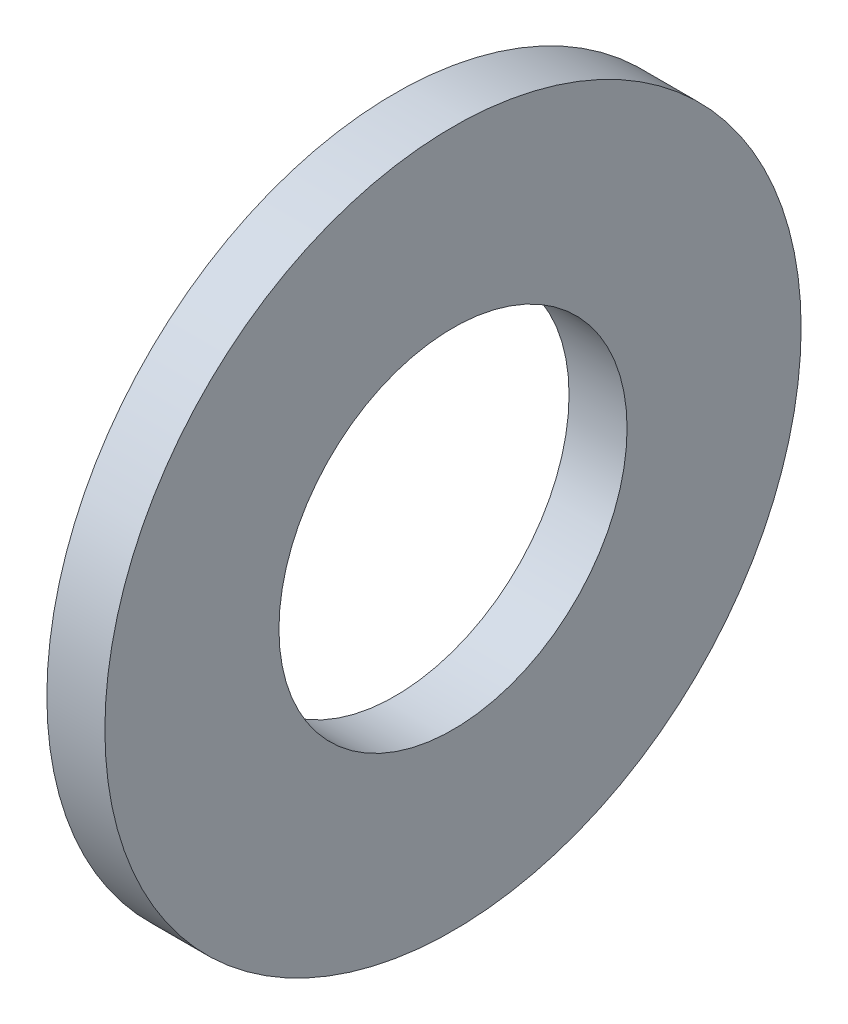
ISO-10303-21;
HEADER;
FILE_DESCRIPTION(('STEP AP214'),'2;1');
FILE_NAME('part.step','',(''),(''),'','','');
FILE_SCHEMA(('AUTOMOTIVE_DESIGN { 1 0 10303 214 1 1 1 1 }'));
ENDSEC;
DATA;
#1=APPLICATION_CONTEXT('core data for automotive mechanical design processes');
#2=APPLICATION_PROTOCOL_DEFINITION('international standard','automotive_design',2000,#1);
#3=PRODUCT_CONTEXT('',#1,'mechanical');
#4=PRODUCT('Part','Part','',(#3));
#5=PRODUCT_RELATED_PRODUCT_CATEGORY('part','',(#4));
#6=PRODUCT_DEFINITION_FORMATION('','',#4);
#7=PRODUCT_DEFINITION_CONTEXT('part definition',#1,'design');
#8=PRODUCT_DEFINITION('design','',#6,#7);
#9=PRODUCT_DEFINITION_SHAPE('','',#8);
#10=(LENGTH_UNIT() NAMED_UNIT(*) SI_UNIT(.MILLI.,.METRE.));
#11=(NAMED_UNIT(*) PLANE_ANGLE_UNIT() SI_UNIT($,.RADIAN.));
#12=(NAMED_UNIT(*) SI_UNIT($,.STERADIAN.) SOLID_ANGLE_UNIT());
#13=UNCERTAINTY_MEASURE_WITH_UNIT(LENGTH_MEASURE(1.E-05),#10,'distance_accuracy_value','');
#14=(GEOMETRIC_REPRESENTATION_CONTEXT(3) GLOBAL_UNCERTAINTY_ASSIGNED_CONTEXT((#13)) GLOBAL_UNIT_ASSIGNED_CONTEXT((#10,
#11,#12)) REPRESENTATION_CONTEXT('',''));
#15=CARTESIAN_POINT('',(0.,0.,0.));
#16=DIRECTION('',(0.,0.,1.));
#17=DIRECTION('',(1.,0.,0.));
#18=AXIS2_PLACEMENT_3D('',#15,#16,#17);
#19=CARTESIAN_POINT('',(0.,0.,-15.));
#20=DIRECTION('',(1.,0.,0.));
#21=DIRECTION('',(0.,0.,-1.));
#22=AXIS2_PLACEMENT_3D('',#19,#20,#21);
#23=PLANE('',#22);
#24=CARTESIAN_POINT('',(0.,0.,0.));
#25=DIRECTION('',(-1.,0.,0.));
#26=DIRECTION('',(0.,0.,1.));
#27=AXIS2_PLACEMENT_3D('',#24,#25,#26);
#28=CIRCLE('',#27,7.5);
#29=CARTESIAN_POINT('',(0.,0.,7.5));
#30=VERTEX_POINT('',#29);
#31=EDGE_CURVE('E10',#30,#30,#28,.T.);
#32=ORIENTED_EDGE('',*,*,#31,.F.);
#33=EDGE_LOOP('',(#32));
#34=FACE_BOUND('',#33,.T.);
#35=CARTESIAN_POINT('',(0.,0.,0.));
#36=DIRECTION('',(-1.,0.,0.));
#37=DIRECTION('',(0.,0.,1.));
#38=AXIS2_PLACEMENT_3D('',#35,#36,#37);
#39=CIRCLE('',#38,15.);
#40=CARTESIAN_POINT('',(0.,0.,15.));
#41=VERTEX_POINT('',#40);
#42=EDGE_CURVE('E46',#41,#41,#39,.T.);
#43=ORIENTED_EDGE('',*,*,#42,.T.);
#44=EDGE_LOOP('',(#43));
#45=FACE_BOUND('',#44,.T.);
#46=ADVANCED_FACE('F32',(#34,#45),#23,.F.);
#47=CARTESIAN_POINT('',(0.,0.,0.));
#48=DIRECTION('',(-1.,0.,0.));
#49=DIRECTION('',(0.,0.,1.));
#50=AXIS2_PLACEMENT_3D('',#47,#48,#49);
#51=CYLINDRICAL_SURFACE('',#50,7.5);
#52=CARTESIAN_POINT('',(2.5,0.,0.));
#53=DIRECTION('',(-1.,0.,0.));
#54=DIRECTION('',(0.,0.,1.));
#55=AXIS2_PLACEMENT_3D('',#52,#53,#54);
#56=CIRCLE('',#55,7.5);
#57=CARTESIAN_POINT('',(2.5,0.,7.5));
#58=VERTEX_POINT('',#57);
#59=EDGE_CURVE('E38',#58,#58,#56,.T.);
#60=ORIENTED_EDGE('',*,*,#59,.F.);
#61=EDGE_LOOP('',(#60));
#62=FACE_BOUND('',#61,.T.);
#63=ORIENTED_EDGE('',*,*,#31,.T.);
#64=EDGE_LOOP('',(#63));
#65=FACE_BOUND('',#64,.T.);
#66=ADVANCED_FACE('F61',(#62,#65),#51,.F.);
#67=CARTESIAN_POINT('',(2.5,0.,-15.));
#68=DIRECTION('',(-1.,0.,0.));
#69=DIRECTION('',(0.,0.,1.));
#70=AXIS2_PLACEMENT_3D('',#67,#68,#69);
#71=PLANE('',#70);
#72=CARTESIAN_POINT('',(2.5,0.,0.));
#73=DIRECTION('',(-1.,0.,0.));
#74=DIRECTION('',(0.,0.,1.));
#75=AXIS2_PLACEMENT_3D('',#72,#73,#74);
#76=CIRCLE('',#75,15.);
#77=CARTESIAN_POINT('',(2.5,0.,15.));
#78=VERTEX_POINT('',#77);
#79=EDGE_CURVE('E42',#78,#78,#76,.T.);
#80=ORIENTED_EDGE('',*,*,#79,.F.);
#81=EDGE_LOOP('',(#80));
#82=FACE_BOUND('',#81,.T.);
#83=ORIENTED_EDGE('',*,*,#59,.T.);
#84=EDGE_LOOP('',(#83));
#85=FACE_BOUND('',#84,.T.);
#86=ADVANCED_FACE('F56',(#82,#85),#71,.F.);
#87=CARTESIAN_POINT('',(0.,0.,0.));
#88=DIRECTION('',(-1.,0.,0.));
#89=DIRECTION('',(0.,0.,1.));
#90=AXIS2_PLACEMENT_3D('',#87,#88,#89);
#91=CYLINDRICAL_SURFACE('',#90,15.);
#92=ORIENTED_EDGE('',*,*,#42,.F.);
#93=EDGE_LOOP('',(#92));
#94=FACE_BOUND('',#93,.T.);
#95=ORIENTED_EDGE('',*,*,#79,.T.);
#96=EDGE_LOOP('',(#95));
#97=FACE_BOUND('',#96,.T.);
#98=ADVANCED_FACE('F53',(#94,#97),#91,.T.);
#99=CLOSED_SHELL('',(#46,#66,#86,#98));
#100=MANIFOLD_SOLID_BREP('B2',#99);
#101=ADVANCED_BREP_SHAPE_REPRESENTATION('',(#18,#100),#14);
#102=SHAPE_DEFINITION_REPRESENTATION(#9,#101);
ENDSEC;
END-ISO-10303-21;
